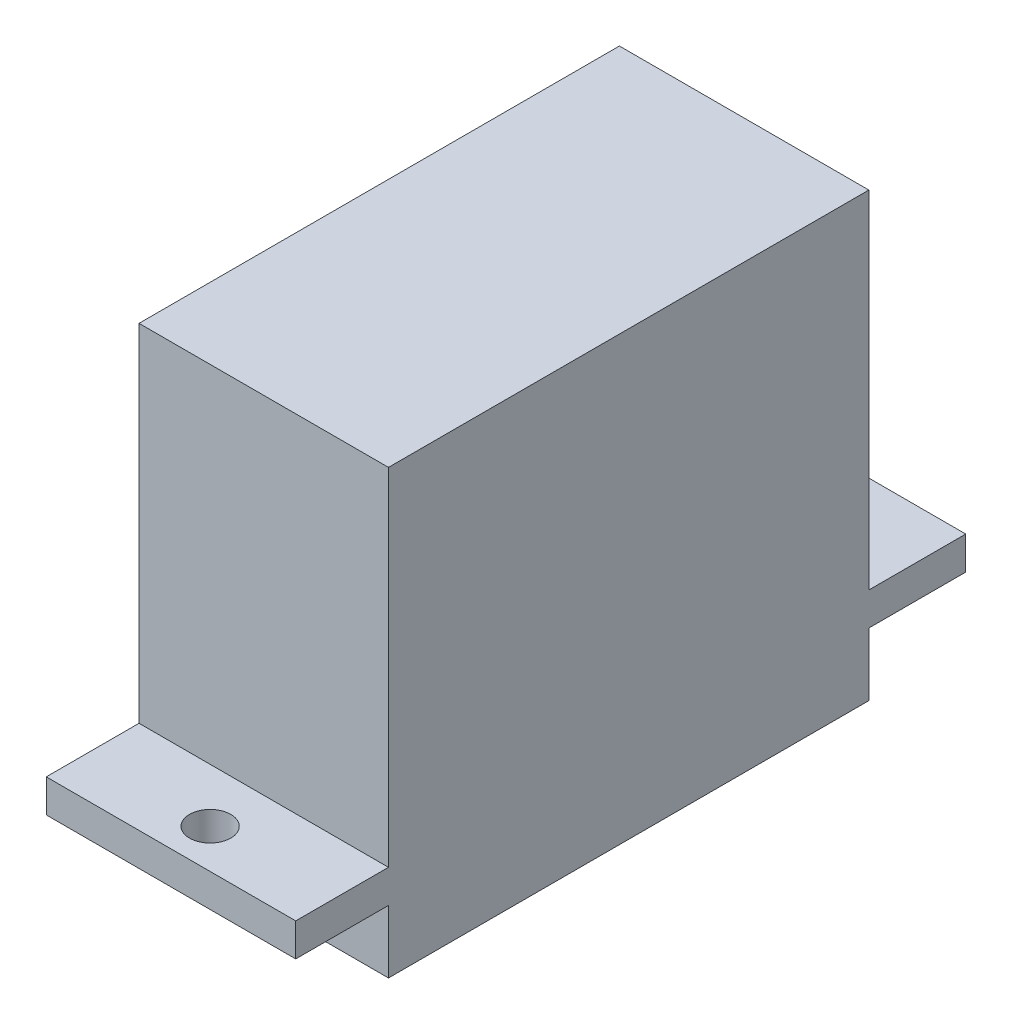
from build123d import *

# Parameters (mm, degrees)
SKETCH_3_W          = 32.5
SKETCH_3_H          = 21.45
EXTRUDE_1_DEPTH     = 6.05
CUT_EXTRUDE_START   = -3.86581
SKETCH_4_W          = 12.1
SKETCH_4_H          = 4.7
SKETCH_4_H_2        = 4.6
CUT_EXTRUDE_1_DEPTH = 26.951221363
CUT_EXTRUDE_START_2 = -5.46581
SKETCH_4_2_W        = 12.1
SKETCH_4_2_H        = 4.7
SKETCH_4_2_H_2      = 4.6
CUT_EXTRUDE_2_DEPTH = 17.619601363
SKETCH_5_R          = 1
CUT_EXTRUDE_3_DEPTH = 23.085411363
SKETCH_7_R          = 1.557821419
SKETCH_7_R_2        = 1.04903278
EXTRUDE_3_DEPTH     = 3


with BuildPart() as part:
    # Sketch 3 → Extrude 1 (new, symmetric)
    with BuildSketch(Plane(origin=(0, 0, 0), x_dir=(0, 0, -1), z_dir=(1, 0, 0))):
        with Locations((-0.5985, 2.2091)):
            Rectangle(SKETCH_3_W, SKETCH_3_H)
    extrude(amount=EXTRUDE_1_DEPTH, both=True)

    # Sketch 4 → Cut-Extrude 1 (cut, through all)
    with BuildSketch(Plane(origin=(0, 0, 0), x_dir=(1, 0, 0), z_dir=(0, 1, 0)).offset(CUT_EXTRUDE_START)):
        with Locations((0, 13.30155)):
            Rectangle(SKETCH_4_W, SKETCH_4_H)
        with Locations((0, -14.6484)):
            Rectangle(SKETCH_4_W, SKETCH_4_H_2)
    extrude(amount=CUT_EXTRUDE_1_DEPTH, mode=Mode.SUBTRACT)

    # Sketch 4_2 → Cut-Extrude 2 (cut, through all)
    with BuildSketch(Plane(origin=(0, 0, 0), x_dir=(1, 0, 0), z_dir=(0, 1, 0)).offset(CUT_EXTRUDE_START_2)):
        with Locations((0, 13.30155)):
            Rectangle(SKETCH_4_2_W, SKETCH_4_2_H)
        with Locations((0, -14.6484)):
            Rectangle(SKETCH_4_2_W, SKETCH_4_2_H_2)
    extrude(amount=-CUT_EXTRUDE_2_DEPTH, mode=Mode.SUBTRACT)

    # Sketch 5 → Cut-Extrude 3 (cut, through all)
    with BuildSketch(Plane(origin=(0, 0, 0), x_dir=(1, 0, 0), z_dir=(0, 1, 0))):
        with Locations(Location((0, 13.55, 0), (0, 0, 90))):
            Circle(SKETCH_5_R)
        with Locations(Location((0, -14.949238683, 0), (0, 0, 90))):
            Circle(SKETCH_5_R)
    extrude(amount=-CUT_EXTRUDE_3_DEPTH, mode=Mode.SUBTRACT)

    # Sketch 7 → Extrude 3 (add)
    with BuildSketch(Plane.XZ.offset(8.5159)):
        with Locations(Location((0, -7.64347992, 0), (0, 0, 90))):
            Circle(SKETCH_7_R)
        with Locations(Location((0, -7.64347992, 0), (0, 0, 270))):
            Circle(SKETCH_7_R_2, mode=Mode.SUBTRACT)
    extrude(amount=EXTRUDE_3_DEPTH)


solid = part.part
